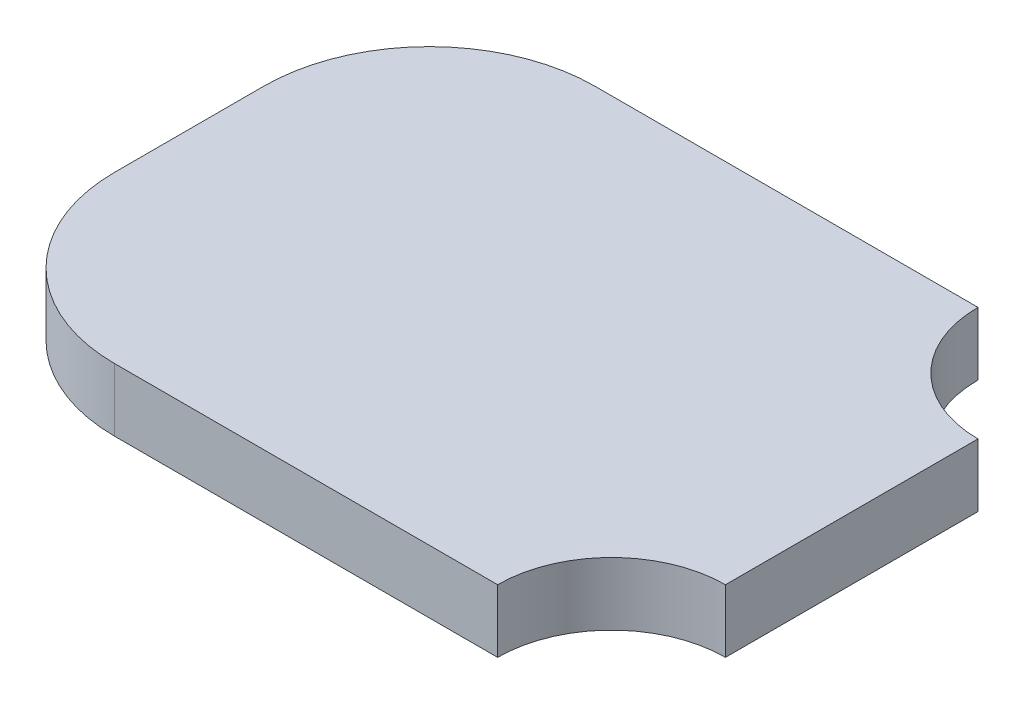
ISO-10303-21;
HEADER;
FILE_DESCRIPTION(('STEP AP214'),'2;1');
FILE_NAME('part.step','',(''),(''),'','','');
FILE_SCHEMA(('AUTOMOTIVE_DESIGN { 1 0 10303 214 1 1 1 1 }'));
ENDSEC;
DATA;
#1=APPLICATION_CONTEXT('core data for automotive mechanical design processes');
#2=APPLICATION_PROTOCOL_DEFINITION('international standard','automotive_design',2000,#1);
#3=PRODUCT_CONTEXT('',#1,'mechanical');
#4=PRODUCT('Part','Part','',(#3));
#5=PRODUCT_RELATED_PRODUCT_CATEGORY('part','',(#4));
#6=PRODUCT_DEFINITION_FORMATION('','',#4);
#7=PRODUCT_DEFINITION_CONTEXT('part definition',#1,'design');
#8=PRODUCT_DEFINITION('design','',#6,#7);
#9=PRODUCT_DEFINITION_SHAPE('','',#8);
#10=(LENGTH_UNIT() NAMED_UNIT(*) SI_UNIT(.MILLI.,.METRE.));
#11=(NAMED_UNIT(*) PLANE_ANGLE_UNIT() SI_UNIT($,.RADIAN.));
#12=(NAMED_UNIT(*) SI_UNIT($,.STERADIAN.) SOLID_ANGLE_UNIT());
#13=UNCERTAINTY_MEASURE_WITH_UNIT(LENGTH_MEASURE(1.E-05),#10,'distance_accuracy_value','');
#14=(GEOMETRIC_REPRESENTATION_CONTEXT(3) GLOBAL_UNCERTAINTY_ASSIGNED_CONTEXT((#13)) GLOBAL_UNIT_ASSIGNED_CONTEXT((#10,
#11,#12)) REPRESENTATION_CONTEXT('',''));
#15=CARTESIAN_POINT('',(0.,0.,0.));
#16=DIRECTION('',(0.,0.,1.));
#17=DIRECTION('',(1.,0.,0.));
#18=AXIS2_PLACEMENT_3D('',#15,#16,#17);
#19=CARTESIAN_POINT('',(-25.4,9.652,-11.43));
#20=DIRECTION('',(0.,-1.,0.));
#21=DIRECTION('',(0.,0.,-1.));
#22=AXIS2_PLACEMENT_3D('',#19,#20,#21);
#23=CYLINDRICAL_SURFACE('',#22,25.4);
#24=CARTESIAN_POINT('',(-25.4,0.,-11.43));
#25=DIRECTION('',(0.,1.,0.));
#26=DIRECTION('',(0.,0.,-1.));
#27=AXIS2_PLACEMENT_3D('',#24,#25,#26);
#28=CIRCLE('',#27,25.4);
#29=CARTESIAN_POINT('',(-25.4,0.,-36.83));
#30=VERTEX_POINT('',#29);
#31=CARTESIAN_POINT('',(-50.8,0.,-11.43));
#32=VERTEX_POINT('',#31);
#33=EDGE_CURVE('E126',#30,#32,#28,.T.);
#34=ORIENTED_EDGE('',*,*,#33,.T.);
#35=DIRECTION('',(0.,-1.,0.));
#36=VECTOR('',#35,1.);
#37=CARTESIAN_POINT('',(-50.8,9.652,-11.43));
#38=LINE('',#37,#36);
#39=CARTESIAN_POINT('',(-50.8,9.652,-11.43));
#40=VERTEX_POINT('',#39);
#41=EDGE_CURVE('E11',#40,#32,#38,.T.);
#42=ORIENTED_EDGE('',*,*,#41,.F.);
#43=CARTESIAN_POINT('',(-25.4,9.652,-11.43));
#44=DIRECTION('',(0.,1.,0.));
#45=DIRECTION('',(0.,0.,-1.));
#46=AXIS2_PLACEMENT_3D('',#43,#44,#45);
#47=CIRCLE('',#46,25.4);
#48=CARTESIAN_POINT('',(-25.4,9.652,-36.83));
#49=VERTEX_POINT('',#48);
#50=EDGE_CURVE('E140',#49,#40,#47,.T.);
#51=ORIENTED_EDGE('',*,*,#50,.F.);
#52=DIRECTION('',(0.,-1.,0.));
#53=VECTOR('',#52,1.);
#54=CARTESIAN_POINT('',(-25.4,9.652,-36.83));
#55=LINE('',#54,#53);
#56=EDGE_CURVE('E122',#49,#30,#55,.T.);
#57=ORIENTED_EDGE('',*,*,#56,.T.);
#58=EDGE_LOOP('',(#34,#42,#51,#57));
#59=FACE_BOUND('',#58,.T.);
#60=ADVANCED_FACE('F30',(#59),#23,.T.);
#61=CARTESIAN_POINT('',(-50.8,9.652,11.43));
#62=DIRECTION('',(1.,0.,0.));
#63=DIRECTION('',(0.,0.,-1.));
#64=AXIS2_PLACEMENT_3D('',#61,#62,#63);
#65=PLANE('',#64);
#66=DIRECTION('',(0.,0.,1.));
#67=VECTOR('',#66,1.);
#68=CARTESIAN_POINT('',(-50.8,0.,11.43));
#69=LINE('',#68,#67);
#70=CARTESIAN_POINT('',(-50.8,0.,11.43));
#71=VERTEX_POINT('',#70);
#72=EDGE_CURVE('E129',#32,#71,#69,.T.);
#73=ORIENTED_EDGE('',*,*,#72,.T.);
#74=DIRECTION('',(0.,-1.,0.));
#75=VECTOR('',#74,1.);
#76=CARTESIAN_POINT('',(-50.8,9.652,11.43));
#77=LINE('',#76,#75);
#78=CARTESIAN_POINT('',(-50.8,9.652,11.43));
#79=VERTEX_POINT('',#78);
#80=EDGE_CURVE('E38',#79,#71,#77,.T.);
#81=ORIENTED_EDGE('',*,*,#80,.F.);
#82=DIRECTION('',(0.,0.,1.));
#83=VECTOR('',#82,1.);
#84=CARTESIAN_POINT('',(-50.8,9.652,11.43));
#85=LINE('',#84,#83);
#86=EDGE_CURVE('E89',#40,#79,#85,.T.);
#87=ORIENTED_EDGE('',*,*,#86,.F.);
#88=ORIENTED_EDGE('',*,*,#41,.T.);
#89=EDGE_LOOP('',(#73,#81,#87,#88));
#90=FACE_BOUND('',#89,.T.);
#91=ADVANCED_FACE('F175',(#90),#65,.F.);
#92=CARTESIAN_POINT('',(-25.4,9.652,11.43));
#93=DIRECTION('',(0.,-1.,0.));
#94=DIRECTION('',(0.,0.,-1.));
#95=AXIS2_PLACEMENT_3D('',#92,#93,#94);
#96=CYLINDRICAL_SURFACE('',#95,25.4);
#97=CARTESIAN_POINT('',(-25.4,0.,11.43));
#98=DIRECTION('',(0.,1.,0.));
#99=DIRECTION('',(0.,0.,-1.));
#100=AXIS2_PLACEMENT_3D('',#97,#98,#99);
#101=CIRCLE('',#100,25.4);
#102=CARTESIAN_POINT('',(-25.4,0.,36.83));
#103=VERTEX_POINT('',#102);
#104=EDGE_CURVE('E131',#71,#103,#101,.T.);
#105=ORIENTED_EDGE('',*,*,#104,.T.);
#106=DIRECTION('',(0.,-1.,0.));
#107=VECTOR('',#106,1.);
#108=CARTESIAN_POINT('',(-25.4,9.652,36.83));
#109=LINE('',#108,#107);
#110=CARTESIAN_POINT('',(-25.4,9.652,36.83));
#111=VERTEX_POINT('',#110);
#112=EDGE_CURVE('E147',#111,#103,#109,.T.);
#113=ORIENTED_EDGE('',*,*,#112,.F.);
#114=CARTESIAN_POINT('',(-25.4,9.652,11.43));
#115=DIRECTION('',(0.,1.,0.));
#116=DIRECTION('',(0.,0.,-1.));
#117=AXIS2_PLACEMENT_3D('',#114,#115,#116);
#118=CIRCLE('',#117,25.4);
#119=EDGE_CURVE('E155',#79,#111,#118,.T.);
#120=ORIENTED_EDGE('',*,*,#119,.F.);
#121=ORIENTED_EDGE('',*,*,#80,.T.);
#122=EDGE_LOOP('',(#105,#113,#120,#121));
#123=FACE_BOUND('',#122,.T.);
#124=ADVANCED_FACE('F153',(#123),#96,.T.);
#125=CARTESIAN_POINT('',(-25.4,9.652,36.83));
#126=DIRECTION('',(0.,0.,-1.));
#127=DIRECTION('',(-1.,0.,0.));
#128=AXIS2_PLACEMENT_3D('',#125,#126,#127);
#129=PLANE('',#128);
#130=DIRECTION('',(1.,0.,0.));
#131=VECTOR('',#130,1.);
#132=CARTESIAN_POINT('',(-25.4,0.,36.83));
#133=LINE('',#132,#131);
#134=CARTESIAN_POINT('',(33.3313105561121,0.,36.83));
#135=VERTEX_POINT('',#134);
#136=EDGE_CURVE('E133',#103,#135,#133,.T.);
#137=ORIENTED_EDGE('',*,*,#136,.T.);
#138=DIRECTION('',(0.,-1.,0.));
#139=VECTOR('',#138,1.);
#140=CARTESIAN_POINT('',(33.3313105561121,9.652,36.83));
#141=LINE('',#140,#139);
#142=CARTESIAN_POINT('',(33.3313105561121,9.652,36.83));
#143=VERTEX_POINT('',#142);
#144=EDGE_CURVE('E144',#143,#135,#141,.T.);
#145=ORIENTED_EDGE('',*,*,#144,.F.);
#146=DIRECTION('',(1.,0.,0.));
#147=VECTOR('',#146,1.);
#148=CARTESIAN_POINT('',(-25.4,9.652,36.83));
#149=LINE('',#148,#147);
#150=EDGE_CURVE('E167',#111,#143,#149,.T.);
#151=ORIENTED_EDGE('',*,*,#150,.F.);
#152=ORIENTED_EDGE('',*,*,#112,.T.);
#153=EDGE_LOOP('',(#137,#145,#151,#152));
#154=FACE_BOUND('',#153,.T.);
#155=ADVANCED_FACE('F163',(#154),#129,.F.);
#156=CARTESIAN_POINT('',(50.8,9.652,36.83));
#157=DIRECTION('',(0.,-1.,0.));
#158=DIRECTION('',(0.,0.,-1.));
#159=AXIS2_PLACEMENT_3D('',#156,#157,#158);
#160=CYLINDRICAL_SURFACE('',#159,17.4686894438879);
#161=CARTESIAN_POINT('',(50.8,0.,36.83));
#162=DIRECTION('',(0.,-1.,0.));
#163=DIRECTION('',(0.,0.,-1.));
#164=AXIS2_PLACEMENT_3D('',#161,#162,#163);
#165=CIRCLE('',#164,17.4686894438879);
#166=CARTESIAN_POINT('',(50.8,0.,19.3613105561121));
#167=VERTEX_POINT('',#166);
#168=EDGE_CURVE('E135',#135,#167,#165,.T.);
#169=ORIENTED_EDGE('',*,*,#168,.T.);
#170=DIRECTION('',(0.,-1.,0.));
#171=VECTOR('',#170,1.);
#172=CARTESIAN_POINT('',(50.8,9.652,19.3613105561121));
#173=LINE('',#172,#171);
#174=CARTESIAN_POINT('',(50.8,9.652,19.3613105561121));
#175=VERTEX_POINT('',#174);
#176=EDGE_CURVE('E117',#175,#167,#173,.T.);
#177=ORIENTED_EDGE('',*,*,#176,.F.);
#178=CARTESIAN_POINT('',(50.8,9.652,36.83));
#179=DIRECTION('',(0.,-1.,0.));
#180=DIRECTION('',(0.,0.,-1.));
#181=AXIS2_PLACEMENT_3D('',#178,#179,#180);
#182=CIRCLE('',#181,17.4686894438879);
#183=EDGE_CURVE('E108',#143,#175,#182,.T.);
#184=ORIENTED_EDGE('',*,*,#183,.F.);
#185=ORIENTED_EDGE('',*,*,#144,.T.);
#186=EDGE_LOOP('',(#169,#177,#184,#185));
#187=FACE_BOUND('',#186,.T.);
#188=ADVANCED_FACE('F166',(#187),#160,.F.);
#189=CARTESIAN_POINT('',(50.8,9.652,19.3613105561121));
#190=DIRECTION('',(-1.,0.,0.));
#191=DIRECTION('',(0.,0.,1.));
#192=AXIS2_PLACEMENT_3D('',#189,#190,#191);
#193=PLANE('',#192);
#194=DIRECTION('',(0.,0.,-1.));
#195=VECTOR('',#194,1.);
#196=CARTESIAN_POINT('',(50.8,0.,19.3613105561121));
#197=LINE('',#196,#195);
#198=CARTESIAN_POINT('',(50.8,0.,-19.3613105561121));
#199=VERTEX_POINT('',#198);
#200=EDGE_CURVE('E116',#167,#199,#197,.T.);
#201=ORIENTED_EDGE('',*,*,#200,.T.);
#202=DIRECTION('',(0.,-1.,0.));
#203=VECTOR('',#202,1.);
#204=CARTESIAN_POINT('',(50.8,9.652,-19.3613105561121));
#205=LINE('',#204,#203);
#206=CARTESIAN_POINT('',(50.8,9.652,-19.3613105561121));
#207=VERTEX_POINT('',#206);
#208=EDGE_CURVE('E113',#207,#199,#205,.T.);
#209=ORIENTED_EDGE('',*,*,#208,.F.);
#210=DIRECTION('',(0.,0.,-1.));
#211=VECTOR('',#210,1.);
#212=CARTESIAN_POINT('',(50.8,9.652,19.3613105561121));
#213=LINE('',#212,#211);
#214=EDGE_CURVE('E102',#175,#207,#213,.T.);
#215=ORIENTED_EDGE('',*,*,#214,.F.);
#216=ORIENTED_EDGE('',*,*,#176,.T.);
#217=EDGE_LOOP('',(#201,#209,#215,#216));
#218=FACE_BOUND('',#217,.T.);
#219=ADVANCED_FACE('F114',(#218),#193,.F.);
#220=CARTESIAN_POINT('',(50.8,9.652,-36.83));
#221=DIRECTION('',(0.,-1.,0.));
#222=DIRECTION('',(0.,0.,-1.));
#223=AXIS2_PLACEMENT_3D('',#220,#221,#222);
#224=CYLINDRICAL_SURFACE('',#223,17.4686894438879);
#225=CARTESIAN_POINT('',(50.8,0.,-36.83));
#226=DIRECTION('',(0.,-1.,0.));
#227=DIRECTION('',(0.,0.,1.));
#228=AXIS2_PLACEMENT_3D('',#225,#226,#227);
#229=CIRCLE('',#228,17.4686894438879);
#230=CARTESIAN_POINT('',(33.3313105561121,0.,-36.83));
#231=VERTEX_POINT('',#230);
#232=EDGE_CURVE('E75',#199,#231,#229,.T.);
#233=ORIENTED_EDGE('',*,*,#232,.T.);
#234=DIRECTION('',(0.,-1.,0.));
#235=VECTOR('',#234,1.);
#236=CARTESIAN_POINT('',(33.3313105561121,9.652,-36.83));
#237=LINE('',#236,#235);
#238=CARTESIAN_POINT('',(33.3313105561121,9.652,-36.83));
#239=VERTEX_POINT('',#238);
#240=EDGE_CURVE('E118',#239,#231,#237,.T.);
#241=ORIENTED_EDGE('',*,*,#240,.F.);
#242=CARTESIAN_POINT('',(50.8,9.652,-36.83));
#243=DIRECTION('',(0.,-1.,0.));
#244=DIRECTION('',(0.,0.,1.));
#245=AXIS2_PLACEMENT_3D('',#242,#243,#244);
#246=CIRCLE('',#245,17.4686894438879);
#247=EDGE_CURVE('E106',#207,#239,#246,.T.);
#248=ORIENTED_EDGE('',*,*,#247,.F.);
#249=ORIENTED_EDGE('',*,*,#208,.T.);
#250=EDGE_LOOP('',(#233,#241,#248,#249));
#251=FACE_BOUND('',#250,.T.);
#252=ADVANCED_FACE('F120',(#251),#224,.F.);
#253=CARTESIAN_POINT('',(-25.4,9.652,-36.83));
#254=DIRECTION('',(0.,0.,1.));
#255=DIRECTION('',(1.,0.,0.));
#256=AXIS2_PLACEMENT_3D('',#253,#254,#255);
#257=PLANE('',#256);
#258=DIRECTION('',(-1.,0.,0.));
#259=VECTOR('',#258,1.);
#260=CARTESIAN_POINT('',(-25.4,0.,-36.83));
#261=LINE('',#260,#259);
#262=EDGE_CURVE('E81',#231,#30,#261,.T.);
#263=ORIENTED_EDGE('',*,*,#262,.T.);
#264=ORIENTED_EDGE('',*,*,#56,.F.);
#265=DIRECTION('',(-1.,0.,0.));
#266=VECTOR('',#265,1.);
#267=CARTESIAN_POINT('',(-25.4,9.652,-36.83));
#268=LINE('',#267,#266);
#269=EDGE_CURVE('E46',#239,#49,#268,.T.);
#270=ORIENTED_EDGE('',*,*,#269,.F.);
#271=ORIENTED_EDGE('',*,*,#240,.T.);
#272=EDGE_LOOP('',(#263,#264,#270,#271));
#273=FACE_BOUND('',#272,.T.);
#274=ADVANCED_FACE('F191',(#273),#257,.F.);
#275=CARTESIAN_POINT('',(-25.4,9.652,-11.43));
#276=DIRECTION('',(0.,-1.,0.));
#277=DIRECTION('',(0.,0.,-1.));
#278=AXIS2_PLACEMENT_3D('',#275,#276,#277);
#279=PLANE('',#278);
#280=ORIENTED_EDGE('',*,*,#50,.T.);
#281=ORIENTED_EDGE('',*,*,#86,.T.);
#282=ORIENTED_EDGE('',*,*,#119,.T.);
#283=ORIENTED_EDGE('',*,*,#150,.T.);
#284=ORIENTED_EDGE('',*,*,#183,.T.);
#285=ORIENTED_EDGE('',*,*,#214,.T.);
#286=ORIENTED_EDGE('',*,*,#247,.T.);
#287=ORIENTED_EDGE('',*,*,#269,.T.);
#288=EDGE_LOOP('',(#280,#281,#282,#283,#284,#285,#286,#287));
#289=FACE_BOUND('',#288,.T.);
#290=ADVANCED_FACE('F104',(#289),#279,.F.);
#291=CARTESIAN_POINT('',(-25.4,0.,-11.43));
#292=DIRECTION('',(0.,-1.,0.));
#293=DIRECTION('',(0.,0.,-1.));
#294=AXIS2_PLACEMENT_3D('',#291,#292,#293);
#295=PLANE('',#294);
#296=ORIENTED_EDGE('',*,*,#33,.F.);
#297=ORIENTED_EDGE('',*,*,#262,.F.);
#298=ORIENTED_EDGE('',*,*,#232,.F.);
#299=ORIENTED_EDGE('',*,*,#200,.F.);
#300=ORIENTED_EDGE('',*,*,#168,.F.);
#301=ORIENTED_EDGE('',*,*,#136,.F.);
#302=ORIENTED_EDGE('',*,*,#104,.F.);
#303=ORIENTED_EDGE('',*,*,#72,.F.);
#304=EDGE_LOOP('',(#296,#297,#298,#299,#300,#301,#302,#303));
#305=FACE_BOUND('',#304,.T.);
#306=ADVANCED_FACE('F159',(#305),#295,.T.);
#307=CLOSED_SHELL('',(#60,#91,#124,#155,#188,#219,#252,#274,#290,#306));
#308=MANIFOLD_SOLID_BREP('B2',#307);
#309=ADVANCED_BREP_SHAPE_REPRESENTATION('',(#18,#308),#14);
#310=SHAPE_DEFINITION_REPRESENTATION(#9,#309);
ENDSEC;
END-ISO-10303-21;
